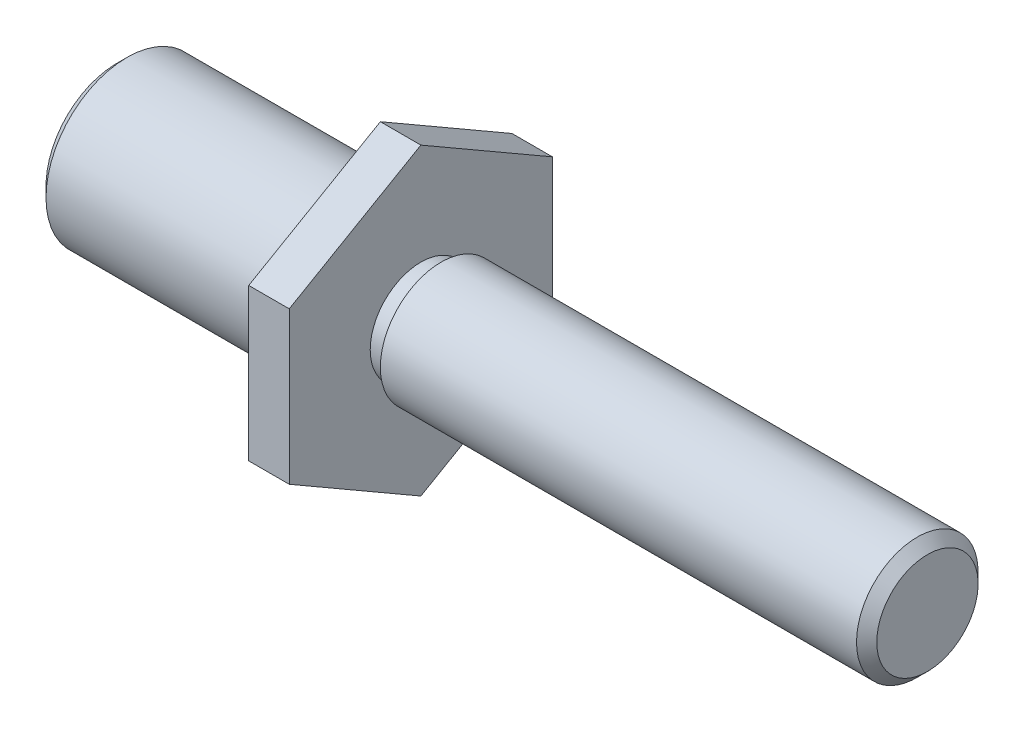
from build123d import *

# Parameters (mm, degrees)
CHANFREIN1_SIZE         = 0.5
ESQUISSE3_OUTSIDE_W     = 26.056
ESQUISSE3_OUTSIDE_H     = 26.056
ENL_V_MAT_EXTRU_2_DEPTH = 42.382363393


with BuildPart() as part:
    # Esquisse1 → Base-R_volution (revolve)
    with BuildSketch(Plane.XY, mode=Mode.PRIVATE) as base_r_volution_sk:
        Polygon((0, 0), (0, 4), (12, 4), (12, 3.5), (13, 3.5), (13, 7.5), (15, 7.5), (15, 2.5), (16, 2.5), (16, 3), (40, 3), (40, 0), align=None)
    revolve(base_r_volution_sk.sketch.rotate(Axis((0, 0, 0), (1, 0, 0)), 90), axis=Axis((0, 0, 0), (1, 0, 0)))

    # Chanfrein1
    chanfrein1_edges = [part.edges().sort_by_distance(p)[0] for p in [
        (0, 0, -4),
        (40, 0, -3),
    ]]
    chamfer(chanfrein1_edges, length=CHANFREIN1_SIZE)

    # Esquisse3 outside → Enl_v. mat.-Extru.2 (cut, through all)
    with BuildSketch(Plane(origin=(0, 0, 0), x_dir=(0, 0, -1), z_dir=(1, 0, 0))):
        Rectangle(ESQUISSE3_OUTSIDE_W, ESQUISSE3_OUTSIDE_H)
        Polygon((-6.495190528, 3.75), (-6.495190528, -3.75), (0, -7.5), (6.495190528, -3.75), (6.495190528, 3.75), (0, 7.5), align=None, mode=Mode.SUBTRACT)
    extrude(amount=ENL_V_MAT_EXTRU_2_DEPTH, mode=Mode.SUBTRACT)


solid = part.part
